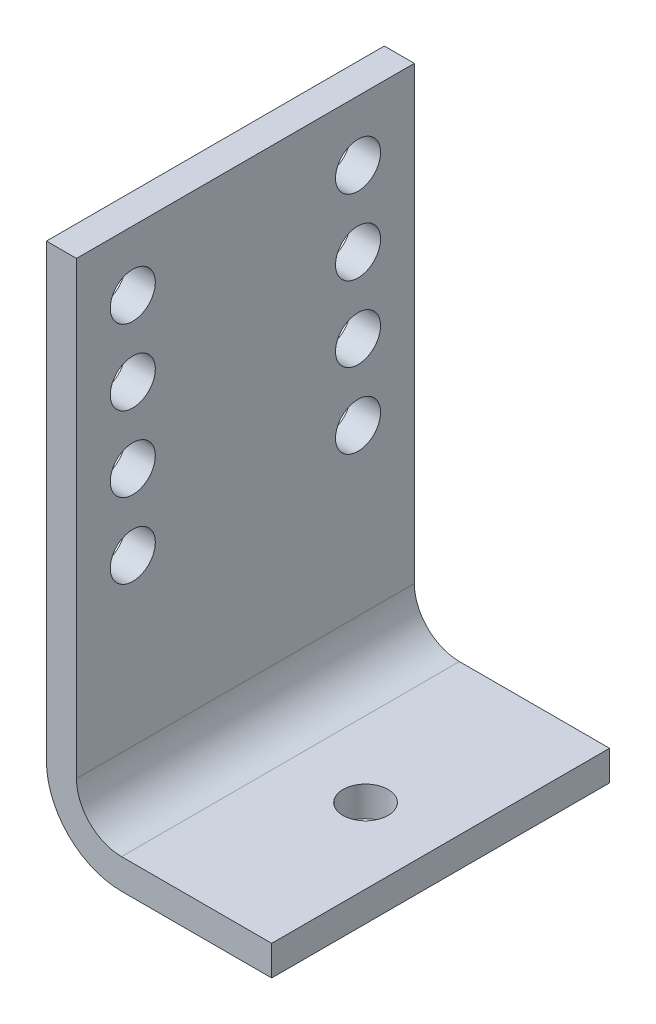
from build123d import *

# Parameters (mm, degrees)
BASE_EXTRUDE_THIN_DEPTH = 22.5
SKETCH2_R               = 3
CUT_EXTRUDE1_DEPTH      = 78.988781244
LPATTERN3_COUNT         = 4
LPATTERN3_PITCH         = 10
SKETCH3_R               = 3
CUT_EXTRUDE2_DEPTH      = 76.909485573


with BuildPart() as part:
    # Sketch1 → Base-Extrude-Thin (new, symmetric)
    with BuildSketch(Plane.XY):
        with BuildLine():
            Line((0, 70), (0, 10))
            ThreePointArc((0, 10), (2.928932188, 2.928932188), (10, 0))
            Line((10, 0), (30, 0))
            Line((30, 0), (30, 4))
            Line((30, 4), (10, 4))
            ThreePointArc((10, 4), (5.757359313, 5.757359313), (4, 10))
            Line((4, 10), (4, 70))
            Line((4, 70), (0, 70))
        make_face()
    extrude(amount=BASE_EXTRUDE_THIN_DEPTH, both=True)

    # Sketch2 → Cut-Extrude1 (cut, through all)
    with BuildSketch(Plane(origin=(4, 0, 0), x_dir=(0, 0, -1), z_dir=(1, 0, 0))):
        with Locations(Location((-15, 62, 0), (0, 0, 270))):
            Circle(SKETCH2_R)
        with Locations(Location((15, 62, 0), (0, 0, 90))):
            Circle(SKETCH2_R)
    cut_extrude1 = extrude(amount=-CUT_EXTRUDE1_DEPTH, mode=Mode.SUBTRACT)

    # LPattern3: Cut-Extrude1 ×4
    with Locations(*[(0, -i * LPATTERN3_PITCH, 0) for i in range(1, LPATTERN3_COUNT)]):
        add(cut_extrude1, mode=Mode.SUBTRACT)

    # Sketch3 → Cut-Extrude2 (cut, through all)
    with BuildSketch(Plane(origin=(0, 4, 0), x_dir=(-1, 0, 0), z_dir=(0, 1, 0))):
        with Locations(Location((-20, 0, 0), (0, 0, 90))):
            Circle(SKETCH3_R)
    extrude(amount=-CUT_EXTRUDE2_DEPTH, mode=Mode.SUBTRACT)


solid = part.part
